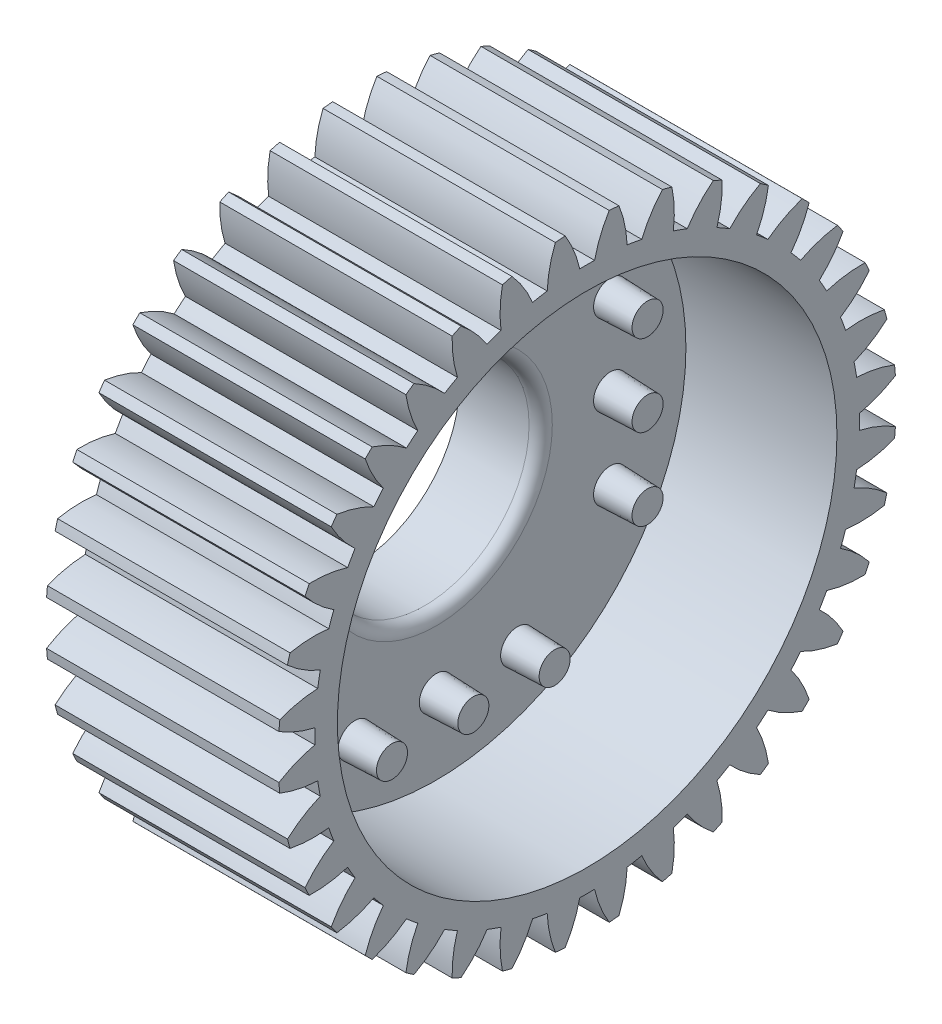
from build123d import *

# Parameters (mm, degrees)
BASPROSKE_W                    = 10
BASPROSKE_H                    = 13.3
TOOTHCUT_DEPTH                 = 22.302112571
TEETHCUTS_COUNT                = 36
BORSKE_R                       = 11
BORE_DEPTH                     = 50.0000508
BOSS_EXTRUDE1_START            = 3.5
SKETCH1_R                      = 11
SKETCH1_R_2                    = 4.5
BOSS_EXTRUDE1_DEPTH            = 3.5
SKETCH2_R                      = 11
SKETCH2_R_2                    = 10.75
BOSS_EXTRUDE2_DEPTH            = 10
SKETCH3_R                      = 0.725
BOSS_EXTRUDE3_DEPTH            = 1.6
BOSS_EXTRUDE3_DRAFT            = 2
BOSS_EXTRUDE3_PROFILE_2_DEPTH  = 1.6
BOSS_EXTRUDE3_PROFILE_2_DRAFT  = 2
BOSS_EXTRUDE3_PROFILE_3_DEPTH  = 1.6
BOSS_EXTRUDE3_PROFILE_3_DRAFT  = 2
BOSS_EXTRUDE3_PROFILE_4_DEPTH  = 1.6
BOSS_EXTRUDE3_PROFILE_4_DRAFT  = 2
BOSS_EXTRUDE3_PROFILE_5_DEPTH  = 1.6
BOSS_EXTRUDE3_PROFILE_5_DRAFT  = 2
BOSS_EXTRUDE3_PROFILE_6_DEPTH  = 1.6
BOSS_EXTRUDE3_PROFILE_6_DRAFT  = 2
BOSS_EXTRUDE3_PROFILE_7_DEPTH  = 1.6
BOSS_EXTRUDE3_PROFILE_7_DRAFT  = 2
BOSS_EXTRUDE3_PROFILE_8_DEPTH  = 1.6
BOSS_EXTRUDE3_PROFILE_8_DRAFT  = 2
BOSS_EXTRUDE3_PROFILE_9_DEPTH  = 1.6
BOSS_EXTRUDE3_PROFILE_9_DRAFT  = 2
BOSS_EXTRUDE3_PROFILE_10_DEPTH = 1.6
BOSS_EXTRUDE3_PROFILE_10_DRAFT = 2
BOSS_EXTRUDE3_PROFILE_11_DEPTH = 1.6
BOSS_EXTRUDE3_PROFILE_11_DRAFT = 2
BOSS_EXTRUDE3_PROFILE_12_DEPTH = 1.6
BOSS_EXTRUDE3_PROFILE_12_DRAFT = 2
FILLET1_R                      = 0.5


with BuildPart() as part:
    # BasProSke → Base-Revolve (revolve)
    with BuildSketch(Plane(origin=(0, 0, 0), x_dir=(1, 0, 0), z_dir=(0, 1, 0)), mode=Mode.PRIVATE) as base_revolve_sk:
        with Locations((5, 6.65)):
            Rectangle(BASPROSKE_W, BASPROSKE_H)
    revolve(base_revolve_sk.sketch.rotate(Axis((-10, 0, 0), (1, 0, 0)), 180), axis=Axis((-10, 0, 0), (1, 0, 0)))

    # TooCutSke → ToothCut (cut, through all)
    with BuildSketch(Plane(origin=(0, 0, 0), x_dir=(0, 0, -1), z_dir=(1, 0, 0))):
        with BuildLine():
            ThreePointArc((0.318850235, 11.719663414), (0, 11.724), (-0.318850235, 11.719663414))
            ThreePointArc((-0.318850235, 11.719663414), (-0.574563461, 12.53243609), (-0.963536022, 13.290518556))
            ThreePointArc((-0.963536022, 13.290518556), (0, 13.3254), (0.963536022, 13.290518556))
            ThreePointArc((0.963536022, 13.290518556), (0.574563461, 12.53243609), (0.318850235, 11.719663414))
        make_face()
    toothcut = extrude(amount=TOOTHCUT_DEPTH, mode=Mode.SUBTRACT)

    # TeethCuts: ToothCut ×36 about axis
    teethcuts_axis = Axis((0, 0, 0), (1, 0, 0))
    for i in range(1, TEETHCUTS_COUNT):
        add(toothcut.rotate(teethcuts_axis, i * 360 / TEETHCUTS_COUNT), mode=Mode.SUBTRACT)

    # BorSke → Bore (cut, symmetric)
    with BuildSketch(Plane(origin=(0, 0, 0), x_dir=(0, 0, -1), z_dir=(1, 0, 0))):
        with Locations(Location((0, 0, 0), (0, 0, 180))):
            Circle(BORSKE_R)
    extrude(amount=BORE_DEPTH, both=True, mode=Mode.SUBTRACT)

    # Sketch1 → Boss-Extrude1 (add)
    with BuildSketch(Plane(origin=(0, 0, 0), x_dir=(0, 0, -1), z_dir=(1, 0, 0)).offset(BOSS_EXTRUDE1_START)):
        with Locations(Location((0, 0, 0), (0, 0, 180))):
            Circle(SKETCH1_R)
        Circle(SKETCH1_R_2, mode=Mode.SUBTRACT)
    extrude(amount=-BOSS_EXTRUDE1_DEPTH)

    # Sketch2 → Boss-Extrude2 (add)
    with BuildSketch(Plane(origin=(10, 0, 0), x_dir=(0, 0, -1), z_dir=(1, 0, 0))):
        Circle(SKETCH2_R)
        Circle(SKETCH2_R_2, mode=Mode.SUBTRACT)
    extrude(amount=-BOSS_EXTRUDE2_DEPTH)


with BuildPart() as boss_extrude3_tool:
    # Sketch3 → Boss-Extrude3 (with draft: the straight prism first)
    with BuildSketch(Plane(origin=(3.5, 0, 0), x_dir=(0, 0, -1), z_dir=(1, 0, 0))):
        with Locations((-3.5, 7.5)):
            Circle(SKETCH3_R)
    extrude(amount=BOSS_EXTRUDE3_DEPTH)
    # Boss-Extrude3: the draft: its side faces are tilted about the plane it starts from
    boss_extrude3_sides = [boss_extrude3_tool.faces().sort_by_distance(p)[0] for p in [
        (4.3, 7.5, 4.225),
    ]]
    draft(boss_extrude3_sides, Plane(origin=(3.5, 0, 0), x_dir=(0, 0, -1), z_dir=(1, 0, 0)), BOSS_EXTRUDE3_DRAFT)


with BuildPart() as part_1:
    add(part.part)

    # Boss-Extrude3: add boss_extrude3_tool
    add(boss_extrude3_tool.part)


with BuildPart() as boss_extrude3_profile_2_tool:
    # Sketch3 → Boss-Extrude3 profile 2 (with draft: the straight prism first)
    with BuildSketch(Plane(origin=(3.5, 0, 0), x_dir=(0, 0, -1), z_dir=(1, 0, 0))):
        with Locations((0, 7.5)):
            Circle(SKETCH3_R)
    extrude(amount=BOSS_EXTRUDE3_PROFILE_2_DEPTH)
    # Boss-Extrude3 profile 2: the draft: its side faces are tilted about the plane it starts from
    boss_extrude3_profile_2_sides = [boss_extrude3_profile_2_tool.faces().sort_by_distance(p)[0] for p in [
        (4.3, 7.5, 0.725),
    ]]
    draft(boss_extrude3_profile_2_sides, Plane(origin=(3.5, 0, 0), x_dir=(0, 0, -1), z_dir=(1, 0, 0)), BOSS_EXTRUDE3_PROFILE_2_DRAFT)


with BuildPart() as part_2:
    add(part_1.part)

    # Boss-Extrude3 profile 2: add boss_extrude3_profile_2_tool
    add(boss_extrude3_profile_2_tool.part)


with BuildPart() as boss_extrude3_profile_3_tool:
    # Sketch3 → Boss-Extrude3 profile 3 (with draft: the straight prism first)
    with BuildSketch(Plane(origin=(3.5, 0, 0), x_dir=(0, 0, -1), z_dir=(1, 0, 0))):
        with Locations((3.5, 7.5)):
            Circle(SKETCH3_R)
    extrude(amount=BOSS_EXTRUDE3_PROFILE_3_DEPTH)
    # Boss-Extrude3 profile 3: the draft: its side faces are tilted about the plane it starts from
    boss_extrude3_profile_3_sides = [boss_extrude3_profile_3_tool.faces().sort_by_distance(p)[0] for p in [
        (4.3, 7.5, -2.775),
    ]]
    draft(boss_extrude3_profile_3_sides, Plane(origin=(3.5, 0, 0), x_dir=(0, 0, -1), z_dir=(1, 0, 0)), BOSS_EXTRUDE3_PROFILE_3_DRAFT)


with BuildPart() as part_3:
    add(part_2.part)

    # Boss-Extrude3 profile 3: add boss_extrude3_profile_3_tool
    add(boss_extrude3_profile_3_tool.part)


with BuildPart() as boss_extrude3_profile_4_tool:
    # Sketch3 → Boss-Extrude3 profile 4 (with draft: the straight prism first)
    with BuildSketch(Plane(origin=(3.5, 0, 0), x_dir=(0, 0, -1), z_dir=(1, 0, 0))):
        with Locations((-7.5, -3.5)):
            Circle(SKETCH3_R)
    extrude(amount=BOSS_EXTRUDE3_PROFILE_4_DEPTH)
    # Boss-Extrude3 profile 4: the draft: its side faces are tilted about the plane it starts from
    boss_extrude3_profile_4_sides = [boss_extrude3_profile_4_tool.faces().sort_by_distance(p)[0] for p in [
        (4.3, -3.5, 8.225),
    ]]
    draft(boss_extrude3_profile_4_sides, Plane(origin=(3.5, 0, 0), x_dir=(0, 0, -1), z_dir=(1, 0, 0)), BOSS_EXTRUDE3_PROFILE_4_DRAFT)


with BuildPart() as part_4:
    add(part_3.part)

    # Boss-Extrude3 profile 4: add boss_extrude3_profile_4_tool
    add(boss_extrude3_profile_4_tool.part)


with BuildPart() as boss_extrude3_profile_5_tool:
    # Sketch3 → Boss-Extrude3 profile 5 (with draft: the straight prism first)
    with BuildSketch(Plane(origin=(3.5, 0, 0), x_dir=(0, 0, -1), z_dir=(1, 0, 0))):
        with Locations((-7.5, 0)):
            Circle(SKETCH3_R)
    extrude(amount=BOSS_EXTRUDE3_PROFILE_5_DEPTH)
    # Boss-Extrude3 profile 5: the draft: its side faces are tilted about the plane it starts from
    boss_extrude3_profile_5_sides = [boss_extrude3_profile_5_tool.faces().sort_by_distance(p)[0] for p in [
        (4.3, 0, 8.225),
    ]]
    draft(boss_extrude3_profile_5_sides, Plane(origin=(3.5, 0, 0), x_dir=(0, 0, -1), z_dir=(1, 0, 0)), BOSS_EXTRUDE3_PROFILE_5_DRAFT)


with BuildPart() as part_5:
    add(part_4.part)

    # Boss-Extrude3 profile 5: add boss_extrude3_profile_5_tool
    add(boss_extrude3_profile_5_tool.part)


with BuildPart() as boss_extrude3_profile_6_tool:
    # Sketch3 → Boss-Extrude3 profile 6 (with draft: the straight prism first)
    with BuildSketch(Plane(origin=(3.5, 0, 0), x_dir=(0, 0, -1), z_dir=(1, 0, 0))):
        with Locations((-7.5, 3.5)):
            Circle(SKETCH3_R)
    extrude(amount=BOSS_EXTRUDE3_PROFILE_6_DEPTH)
    # Boss-Extrude3 profile 6: the draft: its side faces are tilted about the plane it starts from
    boss_extrude3_profile_6_sides = [boss_extrude3_profile_6_tool.faces().sort_by_distance(p)[0] for p in [
        (4.3, 3.5, 8.225),
    ]]
    draft(boss_extrude3_profile_6_sides, Plane(origin=(3.5, 0, 0), x_dir=(0, 0, -1), z_dir=(1, 0, 0)), BOSS_EXTRUDE3_PROFILE_6_DRAFT)


with BuildPart() as part_6:
    add(part_5.part)

    # Boss-Extrude3 profile 6: add boss_extrude3_profile_6_tool
    add(boss_extrude3_profile_6_tool.part)


with BuildPart() as boss_extrude3_profile_7_tool:
    # Sketch3 → Boss-Extrude3 profile 7 (with draft: the straight prism first)
    with BuildSketch(Plane(origin=(3.5, 0, 0), x_dir=(0, 0, -1), z_dir=(1, 0, 0))):
        with Locations((7.5, -3.5)):
            Circle(SKETCH3_R)
    extrude(amount=BOSS_EXTRUDE3_PROFILE_7_DEPTH)
    # Boss-Extrude3 profile 7: the draft: its side faces are tilted about the plane it starts from
    boss_extrude3_profile_7_sides = [boss_extrude3_profile_7_tool.faces().sort_by_distance(p)[0] for p in [
        (4.3, -3.5, -6.775),
    ]]
    draft(boss_extrude3_profile_7_sides, Plane(origin=(3.5, 0, 0), x_dir=(0, 0, -1), z_dir=(1, 0, 0)), BOSS_EXTRUDE3_PROFILE_7_DRAFT)


with BuildPart() as part_7:
    add(part_6.part)

    # Boss-Extrude3 profile 7: add boss_extrude3_profile_7_tool
    add(boss_extrude3_profile_7_tool.part)


with BuildPart() as boss_extrude3_profile_8_tool:
    # Sketch3 → Boss-Extrude3 profile 8 (with draft: the straight prism first)
    with BuildSketch(Plane(origin=(3.5, 0, 0), x_dir=(0, 0, -1), z_dir=(1, 0, 0))):
        with Locations((7.5, 0)):
            Circle(SKETCH3_R)
    extrude(amount=BOSS_EXTRUDE3_PROFILE_8_DEPTH)
    # Boss-Extrude3 profile 8: the draft: its side faces are tilted about the plane it starts from
    boss_extrude3_profile_8_sides = [boss_extrude3_profile_8_tool.faces().sort_by_distance(p)[0] for p in [
        (4.3, 0, -6.775),
    ]]
    draft(boss_extrude3_profile_8_sides, Plane(origin=(3.5, 0, 0), x_dir=(0, 0, -1), z_dir=(1, 0, 0)), BOSS_EXTRUDE3_PROFILE_8_DRAFT)


with BuildPart() as part_8:
    add(part_7.part)

    # Boss-Extrude3 profile 8: add boss_extrude3_profile_8_tool
    add(boss_extrude3_profile_8_tool.part)


with BuildPart() as boss_extrude3_profile_9_tool:
    # Sketch3 → Boss-Extrude3 profile 9 (with draft: the straight prism first)
    with BuildSketch(Plane(origin=(3.5, 0, 0), x_dir=(0, 0, -1), z_dir=(1, 0, 0))):
        with Locations((7.5, 3.5)):
            Circle(SKETCH3_R)
    extrude(amount=BOSS_EXTRUDE3_PROFILE_9_DEPTH)
    # Boss-Extrude3 profile 9: the draft: its side faces are tilted about the plane it starts from
    boss_extrude3_profile_9_sides = [boss_extrude3_profile_9_tool.faces().sort_by_distance(p)[0] for p in [
        (4.3, 3.5, -6.775),
    ]]
    draft(boss_extrude3_profile_9_sides, Plane(origin=(3.5, 0, 0), x_dir=(0, 0, -1), z_dir=(1, 0, 0)), BOSS_EXTRUDE3_PROFILE_9_DRAFT)


with BuildPart() as part_9:
    add(part_8.part)

    # Boss-Extrude3 profile 9: add boss_extrude3_profile_9_tool
    add(boss_extrude3_profile_9_tool.part)


with BuildPart() as boss_extrude3_profile_10_tool:
    # Sketch3 → Boss-Extrude3 profile 10 (with draft: the straight prism first)
    with BuildSketch(Plane(origin=(3.5, 0, 0), x_dir=(0, 0, -1), z_dir=(1, 0, 0))):
        with Locations((3.5, -7.5)):
            Circle(SKETCH3_R)
    extrude(amount=BOSS_EXTRUDE3_PROFILE_10_DEPTH)
    # Boss-Extrude3 profile 10: the draft: its side faces are tilted about the plane it starts from
    boss_extrude3_profile_10_sides = [boss_extrude3_profile_10_tool.faces().sort_by_distance(p)[0] for p in [
        (4.3, -7.5, -2.775),
    ]]
    draft(boss_extrude3_profile_10_sides, Plane(origin=(3.5, 0, 0), x_dir=(0, 0, -1), z_dir=(1, 0, 0)), BOSS_EXTRUDE3_PROFILE_10_DRAFT)


with BuildPart() as part_10:
    add(part_9.part)

    # Boss-Extrude3 profile 10: add boss_extrude3_profile_10_tool
    add(boss_extrude3_profile_10_tool.part)


with BuildPart() as boss_extrude3_profile_11_tool:
    # Sketch3 → Boss-Extrude3 profile 11 (with draft: the straight prism first)
    with BuildSketch(Plane(origin=(3.5, 0, 0), x_dir=(0, 0, -1), z_dir=(1, 0, 0))):
        with Locations((0, -7.5)):
            Circle(SKETCH3_R)
    extrude(amount=BOSS_EXTRUDE3_PROFILE_11_DEPTH)
    # Boss-Extrude3 profile 11: the draft: its side faces are tilted about the plane it starts from
    boss_extrude3_profile_11_sides = [boss_extrude3_profile_11_tool.faces().sort_by_distance(p)[0] for p in [
        (4.3, -7.5, 0.725),
    ]]
    draft(boss_extrude3_profile_11_sides, Plane(origin=(3.5, 0, 0), x_dir=(0, 0, -1), z_dir=(1, 0, 0)), BOSS_EXTRUDE3_PROFILE_11_DRAFT)


with BuildPart() as part_11:
    add(part_10.part)

    # Boss-Extrude3 profile 11: add boss_extrude3_profile_11_tool
    add(boss_extrude3_profile_11_tool.part)


with BuildPart() as boss_extrude3_profile_12_tool:
    # Sketch3 → Boss-Extrude3 profile 12 (with draft: the straight prism first)
    with BuildSketch(Plane(origin=(3.5, 0, 0), x_dir=(0, 0, -1), z_dir=(1, 0, 0))):
        with Locations((-3.5, -7.5)):
            Circle(SKETCH3_R)
    extrude(amount=BOSS_EXTRUDE3_PROFILE_12_DEPTH)
    # Boss-Extrude3 profile 12: the draft: its side faces are tilted about the plane it starts from
    boss_extrude3_profile_12_sides = [boss_extrude3_profile_12_tool.faces().sort_by_distance(p)[0] for p in [
        (4.3, -7.5, 4.225),
    ]]
    draft(boss_extrude3_profile_12_sides, Plane(origin=(3.5, 0, 0), x_dir=(0, 0, -1), z_dir=(1, 0, 0)), BOSS_EXTRUDE3_PROFILE_12_DRAFT)


with BuildPart() as part_12:
    add(part_11.part)

    # Boss-Extrude3 profile 12: add boss_extrude3_profile_12_tool
    add(boss_extrude3_profile_12_tool.part)

    # Fillet1
    fillet1_edges = [part_12.edges().sort_by_distance(p)[0] for p in [
        (3.5, 0, 4.5),
    ]]
    fillet(fillet1_edges, radius=FILLET1_R)


solid = part_12.part
